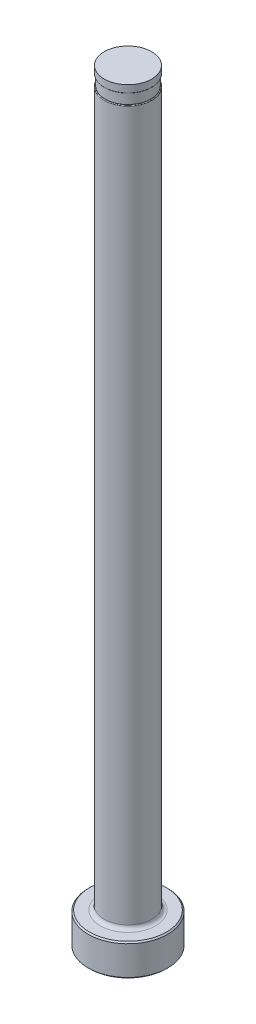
from build123d import *

# Parameters (mm, degrees)
CHAMFER1_SIZE     = 0.254
FILLET1_R         = 0.762
SKETCH2_W         = 0.2032
SKETCH2_H         = 2.032
D_SLOT_DEPTH      = 153.812852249
D_SLOT_DEPTH_BACK = 153.812852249
SKETCH5_W         = 0.0254
SKETCH5_H         = 1.524
FILLET2_R         = 0.127


with BuildPart() as part:
    # Sketch1 → Revolve1 (revolve)
    with BuildSketch(Plane.XY, mode=Mode.PRIVATE) as revolve1_sk:
        Polygon((0, 0), (-7.9375, 0), (-7.9375, 6.35), (-4.7625, 6.35), (-4.7625, 152.4), (0, 152.4), align=None)
    revolve(revolve1_sk.sketch.rotate(Axis((0, 259.958771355, 0), (0, -1, 0)), 270), axis=Axis((0, 259.958771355, 0), (0, -1, 0)))

    # Chamfer1
    chamfer1_edges = [part.edges().sort_by_distance(p)[0] for p in [
        (0, 6.35, -7.9375),
        (0, 0, -7.9375),
    ]]
    chamfer(chamfer1_edges, length=CHAMFER1_SIZE)

    # Fillet1
    fillet1_edges = [part.edges().sort_by_distance(p)[0] for p in [
        (0, 6.35, -4.7625),
    ]]
    fillet(fillet1_edges, radius=FILLET1_R)

    # Sketch2 → Vent Relief (revolve, cut)
    with BuildSketch(Plane.XY, mode=Mode.PRIVATE) as vent_relief_sk:
        with Locations((-4.6609, 149.86)):
            Rectangle(SKETCH2_W, SKETCH2_H)
    revolve(vent_relief_sk.sketch.rotate(Axis((0, 153.448281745, 0), (0, -1, 0)), 270), axis=Axis((0, 153.448281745, 0), (0, -1, 0)), mode=Mode.SUBTRACT)

    # Sketch3 → D-Slot (cut, two sides: drawn at the far end of the back side and taken through both)
    with BuildSketch(Plane.XY.offset(-D_SLOT_DEPTH_BACK)):
        with BuildLine():
            Line((-4.5593, 149.86), (-4.5593, 86.36))
            ThreePointArc((-4.5593, 86.36), (-4.610513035, 85.792038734), (-4.7625, 85.2424))
            Line((-4.7625, 85.2424), (-4.7625, 149.86))
            Line((-4.7625, 149.86), (-4.5593, 149.86))
        make_face()
    extrude(amount=D_SLOT_DEPTH + D_SLOT_DEPTH_BACK, mode=Mode.SUBTRACT)

    # Sketch5 → Vent Diameter (revolve, cut)
    with BuildSketch(Plane.XY, mode=Mode.PRIVATE) as vent_diameter_sk:
        with Locations((-4.7498, 151.638)):
            Rectangle(SKETCH5_W, SKETCH5_H)
    revolve(vent_diameter_sk.sketch.rotate(Axis((0, 152.687735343, 0), (0, -1, 0)), 90), axis=Axis((0, 152.687735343, 0), (0, -1, 0)), mode=Mode.SUBTRACT)

    # Fillet2
    fillet2_edges = [part.edges().sort_by_distance(p)[0] for p in [
        (3.823350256, 148.844, -2.839612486),
        (0, 150.876, 4.7371),
    ]]
    fillet(fillet2_edges, radius=FILLET2_R)


solid = part.part
